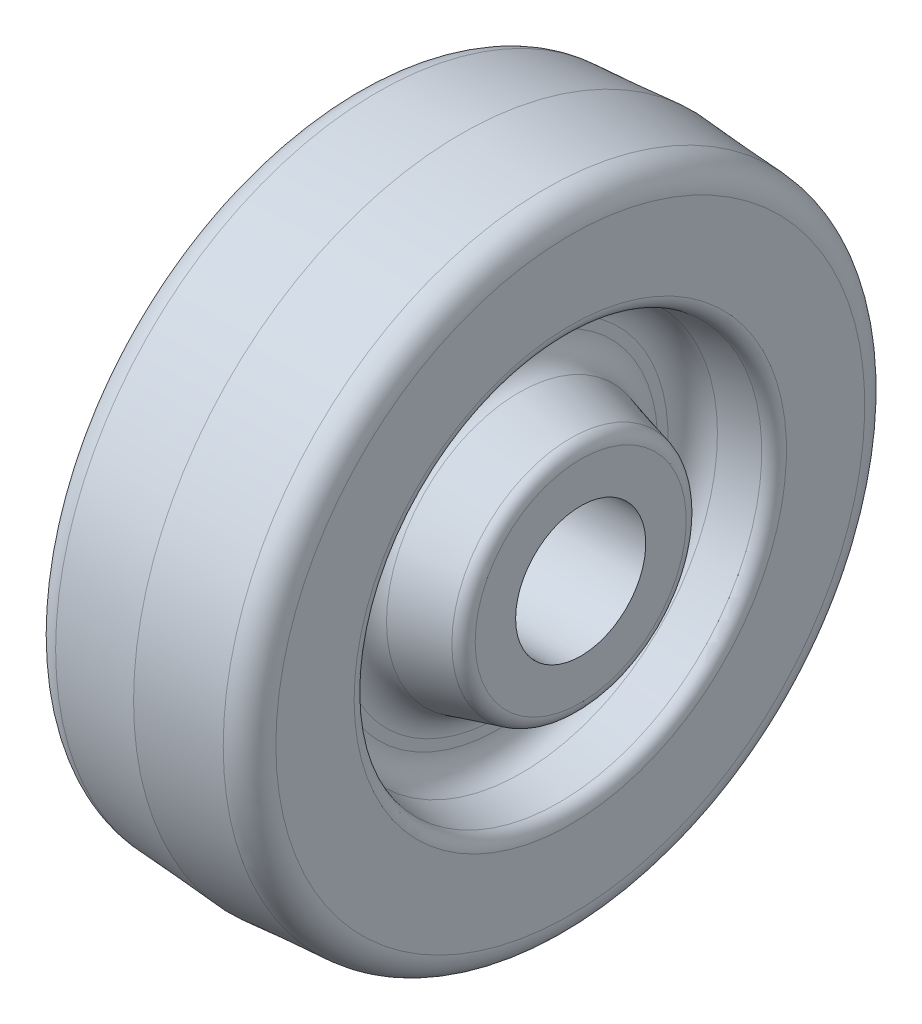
from build123d import *


with BuildPart() as part:
    # Sketch1 → Revolve1 (revolve)
    with BuildSketch(Plane.XY, mode=Mode.PRIVATE) as revolve1_sk:
        with BuildLine():
            Line((0, 76.2), (19.492953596, 74.836919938))
            ThreePointArc((19.492953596, 74.836919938), (23.694096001, 72.833077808), (25.4, 68.502388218))
            Line((25.4, 68.502388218), (25.4, 50.289141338))
            ThreePointArc((25.4, 50.289141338), (24.657191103, 48.248290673), (22.776332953, 47.162376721))
            Line((22.776332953, 47.162376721), (14.010334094, 45.616694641))
            ThreePointArc((14.010334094, 45.616694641), (10.248617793, 43.444866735), (8.763, 39.363165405))
            Line((8.763, 39.363165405), (8.763, 36.964458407))
            ThreePointArc((8.763, 36.964458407), (10.0752063, 33.098823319), (13.469499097, 30.830829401))
            Line((13.469499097, 30.830829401), (25.459750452, 27.618051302))
            ThreePointArc((25.459750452, 27.618051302), (27.15689685, 26.484054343), (27.813, 24.5512368))
            Line((27.813, 24.5512368), (27.813, 15.1384))
            Line((27.813, 15.1384), (-27.813, 15.1384))
            Line((-27.813, 15.1384), (-27.813, 24.5512368))
            ThreePointArc((-27.813, 24.5512368), (-27.15689685, 26.484054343), (-25.459750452, 27.618051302))
            Line((-25.459750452, 27.618051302), (-13.469499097, 30.830829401))
            ThreePointArc((-13.469499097, 30.830829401), (-10.0752063, 33.098823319), (-8.763, 36.964458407))
            Line((-8.763, 36.964458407), (-8.763, 39.363165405))
            ThreePointArc((-8.763, 39.363165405), (-10.248617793, 43.444866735), (-14.010334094, 45.616694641))
            Line((-14.010334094, 45.616694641), (-22.776332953, 47.162376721))
            ThreePointArc((-22.776332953, 47.162376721), (-24.657191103, 48.248290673), (-25.4, 50.289141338))
            Line((-25.4, 50.289141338), (-25.4, 68.502388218))
            ThreePointArc((-25.4, 68.502388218), (-23.694096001, 72.833077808), (-19.492953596, 74.836919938))
            Line((-19.492953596, 74.836919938), (0, 76.2))
        make_face()
    revolve(revolve1_sk.sketch.rotate(Axis((-38.862204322, 0, 0), (1, 0, 0)), 90), axis=Axis((-38.862204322, 0, 0), (1, 0, 0)))


solid = part.part
